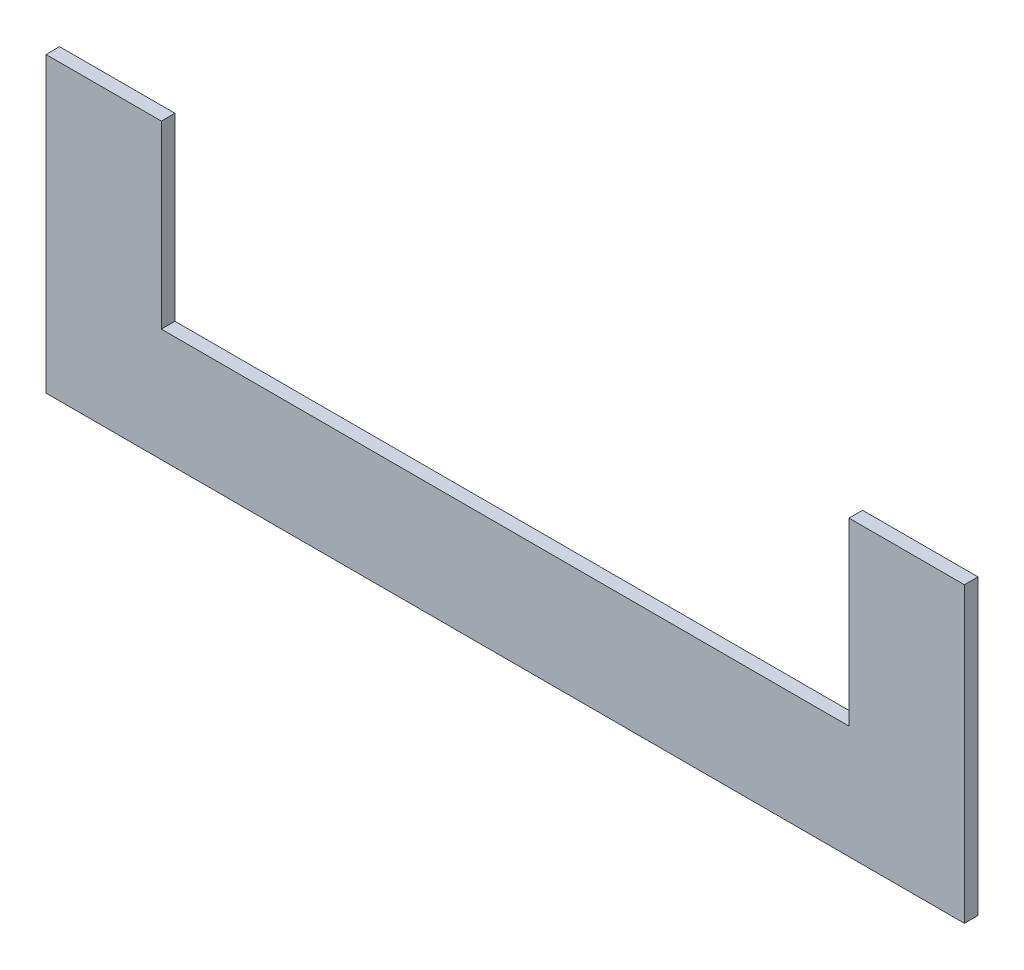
from build123d import *

# Parameters (mm, degrees)
BOSS_EXTRUDE1_DEPTH = 6


with BuildPart() as part:
    # Sketch1 → Boss-Extrude1 (new body)
    with BuildSketch(Plane.XY):
        Polygon((-152, -14.82), (152, -14.82), (152, 64.82), (203, 64.82), (203, -64.82), (-203, -64.82), (-203, 64.82), (-152, 64.82), align=None)
    extrude(amount=BOSS_EXTRUDE1_DEPTH)


solid = part.part
